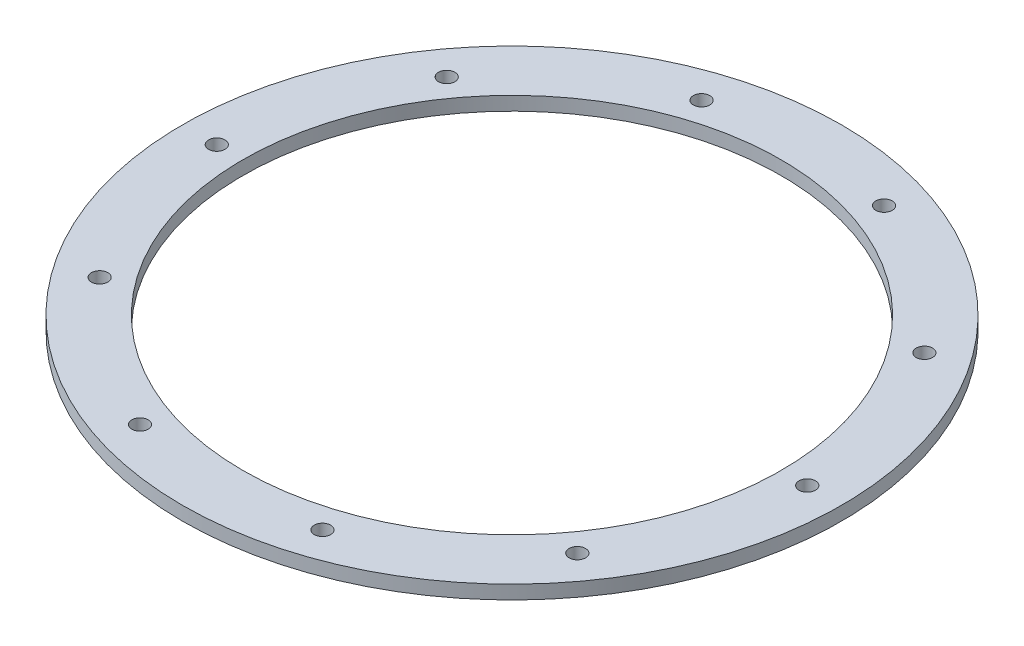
ISO-10303-21;
HEADER;
FILE_DESCRIPTION(('STEP AP214'),'2;1');
FILE_NAME('part.step','',(''),(''),'','','');
FILE_SCHEMA(('AUTOMOTIVE_DESIGN { 1 0 10303 214 1 1 1 1 }'));
ENDSEC;
DATA;
#1=APPLICATION_CONTEXT('core data for automotive mechanical design processes');
#2=APPLICATION_PROTOCOL_DEFINITION('international standard','automotive_design',2000,#1);
#3=PRODUCT_CONTEXT('',#1,'mechanical');
#4=PRODUCT('Part','Part','',(#3));
#5=PRODUCT_RELATED_PRODUCT_CATEGORY('part','',(#4));
#6=PRODUCT_DEFINITION_FORMATION('','',#4);
#7=PRODUCT_DEFINITION_CONTEXT('part definition',#1,'design');
#8=PRODUCT_DEFINITION('design','',#6,#7);
#9=PRODUCT_DEFINITION_SHAPE('','',#8);
#10=(LENGTH_UNIT() NAMED_UNIT(*) SI_UNIT(.MILLI.,.METRE.));
#11=(NAMED_UNIT(*) PLANE_ANGLE_UNIT() SI_UNIT($,.RADIAN.));
#12=(NAMED_UNIT(*) SI_UNIT($,.STERADIAN.) SOLID_ANGLE_UNIT());
#13=UNCERTAINTY_MEASURE_WITH_UNIT(LENGTH_MEASURE(1.E-05),#10,'distance_accuracy_value','');
#14=(GEOMETRIC_REPRESENTATION_CONTEXT(3) GLOBAL_UNCERTAINTY_ASSIGNED_CONTEXT((#13)) GLOBAL_UNIT_ASSIGNED_CONTEXT((#10,
#11,#12)) REPRESENTATION_CONTEXT('',''));
#15=CARTESIAN_POINT('',(0.,0.,0.));
#16=DIRECTION('',(0.,0.,1.));
#17=DIRECTION('',(1.,0.,0.));
#18=AXIS2_PLACEMENT_3D('',#15,#16,#17);
#19=CARTESIAN_POINT('',(0.,3.175,0.));
#20=DIRECTION('',(0.,1.,0.));
#21=DIRECTION('',(0.,0.,1.));
#22=AXIS2_PLACEMENT_3D('',#19,#20,#21);
#23=PLANE('',#22);
#24=CARTESIAN_POINT('',(55.2255225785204,3.175,-40.1236907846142));
#25=DIRECTION('',(0.,1.,0.));
#26=DIRECTION('',(0.,0.,1.));
#27=AXIS2_PLACEMENT_3D('',#24,#25,#26);
#28=CIRCLE('',#27,1.89864999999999);
#29=CARTESIAN_POINT('',(55.2255225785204,3.175,-38.2250407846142));
#30=VERTEX_POINT('',#29);
#31=EDGE_CURVE('E117',#30,#30,#28,.T.);
#32=ORIENTED_EDGE('',*,*,#31,.F.);
#33=EDGE_LOOP('',(#32));
#34=FACE_BOUND('',#33,.T.);
#35=CARTESIAN_POINT('',(21.0942725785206,3.175,-64.9214954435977));
#36=DIRECTION('',(0.,1.,0.));
#37=DIRECTION('',(0.,0.,1.));
#38=AXIS2_PLACEMENT_3D('',#35,#36,#37);
#39=CIRCLE('',#38,1.89864999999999);
#40=CARTESIAN_POINT('',(21.0942725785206,3.175,-63.0228454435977));
#41=VERTEX_POINT('',#40);
#42=EDGE_CURVE('E111',#41,#41,#39,.T.);
#43=ORIENTED_EDGE('',*,*,#42,.F.);
#44=EDGE_LOOP('',(#43));
#45=FACE_BOUND('',#44,.T.);
#46=CARTESIAN_POINT('',(-21.0942725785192,3.175,-64.9214954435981));
#47=DIRECTION('',(0.,1.,0.));
#48=DIRECTION('',(0.,0.,1.));
#49=AXIS2_PLACEMENT_3D('',#46,#47,#48);
#50=CIRCLE('',#49,1.89864999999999);
#51=CARTESIAN_POINT('',(-21.0942725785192,3.175,-63.0228454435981));
#52=VERTEX_POINT('',#51);
#53=EDGE_CURVE('E105',#52,#52,#50,.T.);
#54=ORIENTED_EDGE('',*,*,#53,.F.);
#55=EDGE_LOOP('',(#54));
#56=FACE_BOUND('',#55,.T.);
#57=CARTESIAN_POINT('',(-55.2255225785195,3.175,-40.1236907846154));
#58=DIRECTION('',(0.,1.,0.));
#59=DIRECTION('',(0.,0.,1.));
#60=AXIS2_PLACEMENT_3D('',#57,#58,#59);
#61=CIRCLE('',#60,1.89864999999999);
#62=CARTESIAN_POINT('',(-55.2255225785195,3.175,-38.2250407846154));
#63=VERTEX_POINT('',#62);
#64=EDGE_CURVE('E99',#63,#63,#61,.T.);
#65=ORIENTED_EDGE('',*,*,#64,.F.);
#66=EDGE_LOOP('',(#65));
#67=FACE_BOUND('',#66,.T.);
#68=CARTESIAN_POINT('',(-68.2625,3.175,-4.68315296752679E-13));
#69=DIRECTION('',(0.,1.,0.));
#70=DIRECTION('',(0.,0.,1.));
#71=AXIS2_PLACEMENT_3D('',#68,#69,#70);
#72=CIRCLE('',#71,1.89864999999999);
#73=CARTESIAN_POINT('',(-68.2625,3.175,1.89864999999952));
#74=VERTEX_POINT('',#73);
#75=EDGE_CURVE('E93',#74,#74,#72,.T.);
#76=ORIENTED_EDGE('',*,*,#75,.F.);
#77=EDGE_LOOP('',(#76));
#78=FACE_BOUND('',#77,.T.);
#79=CARTESIAN_POINT('',(-55.2255225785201,3.175,40.1236907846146));
#80=DIRECTION('',(0.,1.,0.));
#81=DIRECTION('',(0.,0.,1.));
#82=AXIS2_PLACEMENT_3D('',#79,#80,#81);
#83=CIRCLE('',#82,1.89864999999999);
#84=CARTESIAN_POINT('',(-55.2255225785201,3.175,42.0223407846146));
#85=VERTEX_POINT('',#84);
#86=EDGE_CURVE('E87',#85,#85,#83,.T.);
#87=ORIENTED_EDGE('',*,*,#86,.F.);
#88=EDGE_LOOP('',(#87));
#89=FACE_BOUND('',#88,.T.);
#90=CARTESIAN_POINT('',(-21.0942725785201,3.175,64.9214954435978));
#91=DIRECTION('',(0.,1.,0.));
#92=DIRECTION('',(0.,0.,1.));
#93=AXIS2_PLACEMENT_3D('',#90,#91,#92);
#94=CIRCLE('',#93,1.89864999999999);
#95=CARTESIAN_POINT('',(-21.0942725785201,3.175,66.8201454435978));
#96=VERTEX_POINT('',#95);
#97=EDGE_CURVE('E81',#96,#96,#94,.T.);
#98=ORIENTED_EDGE('',*,*,#97,.F.);
#99=EDGE_LOOP('',(#98));
#100=FACE_BOUND('',#99,.T.);
#101=CARTESIAN_POINT('',(21.0942725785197,3.175,64.921495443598));
#102=DIRECTION('',(0.,1.,0.));
#103=DIRECTION('',(0.,0.,1.));
#104=AXIS2_PLACEMENT_3D('',#101,#102,#103);
#105=CIRCLE('',#104,1.89864999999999);
#106=CARTESIAN_POINT('',(21.0942725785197,3.175,66.820145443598));
#107=VERTEX_POINT('',#106);
#108=EDGE_CURVE('E75',#107,#107,#105,.T.);
#109=ORIENTED_EDGE('',*,*,#108,.F.);
#110=EDGE_LOOP('',(#109));
#111=FACE_BOUND('',#110,.T.);
#112=CARTESIAN_POINT('',(55.2255225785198,3.175,40.123690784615));
#113=DIRECTION('',(0.,1.,0.));
#114=DIRECTION('',(0.,0.,1.));
#115=AXIS2_PLACEMENT_3D('',#112,#113,#114);
#116=CIRCLE('',#115,1.89864999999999);
#117=CARTESIAN_POINT('',(55.2255225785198,3.175,42.022340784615));
#118=VERTEX_POINT('',#117);
#119=EDGE_CURVE('E69',#118,#118,#116,.T.);
#120=ORIENTED_EDGE('',*,*,#119,.F.);
#121=EDGE_LOOP('',(#120));
#122=FACE_BOUND('',#121,.T.);
#123=CARTESIAN_POINT('',(68.2625,3.175,0.));
#124=DIRECTION('',(0.,1.,0.));
#125=DIRECTION('',(0.,0.,1.));
#126=AXIS2_PLACEMENT_3D('',#123,#124,#125);
#127=CIRCLE('',#126,1.89864999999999);
#128=CARTESIAN_POINT('',(68.2625,3.175,1.89864999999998));
#129=VERTEX_POINT('',#128);
#130=EDGE_CURVE('E63',#129,#129,#127,.T.);
#131=ORIENTED_EDGE('',*,*,#130,.F.);
#132=EDGE_LOOP('',(#131));
#133=FACE_BOUND('',#132,.T.);
#134=CARTESIAN_POINT('',(0.,3.175,0.));
#135=DIRECTION('',(0.,1.,0.));
#136=DIRECTION('',(0.,0.,1.));
#137=AXIS2_PLACEMENT_3D('',#134,#135,#136);
#138=CIRCLE('',#137,76.2);
#139=CARTESIAN_POINT('',(0.,3.175,76.2));
#140=VERTEX_POINT('',#139);
#141=EDGE_CURVE('E12',#140,#140,#138,.T.);
#142=ORIENTED_EDGE('',*,*,#141,.T.);
#143=EDGE_LOOP('',(#142));
#144=FACE_BOUND('',#143,.T.);
#145=CARTESIAN_POINT('',(0.,3.175,0.));
#146=DIRECTION('',(0.,1.,0.));
#147=DIRECTION('',(0.,0.,1.));
#148=AXIS2_PLACEMENT_3D('',#145,#146,#147);
#149=CIRCLE('',#148,62.23);
#150=CARTESIAN_POINT('',(0.,3.175,62.23));
#151=VERTEX_POINT('',#150);
#152=EDGE_CURVE('E54',#151,#151,#149,.T.);
#153=ORIENTED_EDGE('',*,*,#152,.F.);
#154=EDGE_LOOP('',(#153));
#155=FACE_BOUND('',#154,.T.);
#156=ADVANCED_FACE('F43',(#34,#45,#56,#67,#78,#89,#100,#111,#122,#133,#144,#155),#23,.T.);
#157=CARTESIAN_POINT('',(0.,0.,0.));
#158=DIRECTION('',(0.,1.,0.));
#159=DIRECTION('',(0.,0.,1.));
#160=AXIS2_PLACEMENT_3D('',#157,#158,#159);
#161=PLANE('',#160);
#162=CARTESIAN_POINT('',(55.2255225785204,1.18221404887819E-12,-40.1236907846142));
#163=DIRECTION('',(0.,1.,0.));
#164=DIRECTION('',(0.,0.,1.));
#165=AXIS2_PLACEMENT_3D('',#162,#163,#164);
#166=CIRCLE('',#165,1.89864999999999);
#167=CARTESIAN_POINT('',(55.2255225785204,1.18221404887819E-12,-38.2250407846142));
#168=VERTEX_POINT('',#167);
#169=EDGE_CURVE('E120',#168,#168,#166,.T.);
#170=ORIENTED_EDGE('',*,*,#169,.T.);
#171=EDGE_LOOP('',(#170));
#172=FACE_BOUND('',#171,.T.);
#173=CARTESIAN_POINT('',(21.0942725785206,1.18221404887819E-12,-64.9214954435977));
#174=DIRECTION('',(0.,1.,0.));
#175=DIRECTION('',(0.,0.,1.));
#176=AXIS2_PLACEMENT_3D('',#173,#174,#175);
#177=CIRCLE('',#176,1.89864999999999);
#178=CARTESIAN_POINT('',(21.0942725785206,1.18221404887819E-12,-63.0228454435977));
#179=VERTEX_POINT('',#178);
#180=EDGE_CURVE('E114',#179,#179,#177,.T.);
#181=ORIENTED_EDGE('',*,*,#180,.T.);
#182=EDGE_LOOP('',(#181));
#183=FACE_BOUND('',#182,.T.);
#184=CARTESIAN_POINT('',(-21.0942725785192,1.18221404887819E-12,-64.9214954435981));
#185=DIRECTION('',(0.,1.,0.));
#186=DIRECTION('',(0.,0.,1.));
#187=AXIS2_PLACEMENT_3D('',#184,#185,#186);
#188=CIRCLE('',#187,1.89864999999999);
#189=CARTESIAN_POINT('',(-21.0942725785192,1.18221404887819E-12,-63.0228454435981));
#190=VERTEX_POINT('',#189);
#191=EDGE_CURVE('E108',#190,#190,#188,.T.);
#192=ORIENTED_EDGE('',*,*,#191,.T.);
#193=EDGE_LOOP('',(#192));
#194=FACE_BOUND('',#193,.T.);
#195=CARTESIAN_POINT('',(-55.2255225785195,1.18221404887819E-12,-40.1236907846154));
#196=DIRECTION('',(0.,1.,0.));
#197=DIRECTION('',(0.,0.,1.));
#198=AXIS2_PLACEMENT_3D('',#195,#196,#197);
#199=CIRCLE('',#198,1.89864999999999);
#200=CARTESIAN_POINT('',(-55.2255225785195,1.18221404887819E-12,-38.2250407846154));
#201=VERTEX_POINT('',#200);
#202=EDGE_CURVE('E102',#201,#201,#199,.T.);
#203=ORIENTED_EDGE('',*,*,#202,.T.);
#204=EDGE_LOOP('',(#203));
#205=FACE_BOUND('',#204,.T.);
#206=CARTESIAN_POINT('',(-68.2625,1.18221404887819E-12,-4.68315296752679E-13));
#207=DIRECTION('',(0.,1.,0.));
#208=DIRECTION('',(0.,0.,1.));
#209=AXIS2_PLACEMENT_3D('',#206,#207,#208);
#210=CIRCLE('',#209,1.89864999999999);
#211=CARTESIAN_POINT('',(-68.2625,1.18221404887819E-12,1.89864999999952));
#212=VERTEX_POINT('',#211);
#213=EDGE_CURVE('E96',#212,#212,#210,.T.);
#214=ORIENTED_EDGE('',*,*,#213,.T.);
#215=EDGE_LOOP('',(#214));
#216=FACE_BOUND('',#215,.T.);
#217=CARTESIAN_POINT('',(-55.2255225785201,1.18221404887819E-12,40.1236907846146));
#218=DIRECTION('',(0.,1.,0.));
#219=DIRECTION('',(0.,0.,1.));
#220=AXIS2_PLACEMENT_3D('',#217,#218,#219);
#221=CIRCLE('',#220,1.89864999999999);
#222=CARTESIAN_POINT('',(-55.2255225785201,1.18221404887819E-12,42.0223407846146));
#223=VERTEX_POINT('',#222);
#224=EDGE_CURVE('E90',#223,#223,#221,.T.);
#225=ORIENTED_EDGE('',*,*,#224,.T.);
#226=EDGE_LOOP('',(#225));
#227=FACE_BOUND('',#226,.T.);
#228=CARTESIAN_POINT('',(-21.0942725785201,1.18221404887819E-12,64.9214954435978));
#229=DIRECTION('',(0.,1.,0.));
#230=DIRECTION('',(0.,0.,1.));
#231=AXIS2_PLACEMENT_3D('',#228,#229,#230);
#232=CIRCLE('',#231,1.89864999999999);
#233=CARTESIAN_POINT('',(-21.0942725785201,1.18221404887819E-12,66.8201454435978));
#234=VERTEX_POINT('',#233);
#235=EDGE_CURVE('E84',#234,#234,#232,.T.);
#236=ORIENTED_EDGE('',*,*,#235,.T.);
#237=EDGE_LOOP('',(#236));
#238=FACE_BOUND('',#237,.T.);
#239=CARTESIAN_POINT('',(21.0942725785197,1.18221404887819E-12,64.921495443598));
#240=DIRECTION('',(0.,1.,0.));
#241=DIRECTION('',(0.,0.,1.));
#242=AXIS2_PLACEMENT_3D('',#239,#240,#241);
#243=CIRCLE('',#242,1.89864999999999);
#244=CARTESIAN_POINT('',(21.0942725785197,1.18221404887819E-12,66.820145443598));
#245=VERTEX_POINT('',#244);
#246=EDGE_CURVE('E78',#245,#245,#243,.T.);
#247=ORIENTED_EDGE('',*,*,#246,.T.);
#248=EDGE_LOOP('',(#247));
#249=FACE_BOUND('',#248,.T.);
#250=CARTESIAN_POINT('',(55.2255225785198,1.18221404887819E-12,40.123690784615));
#251=DIRECTION('',(0.,1.,0.));
#252=DIRECTION('',(0.,0.,1.));
#253=AXIS2_PLACEMENT_3D('',#250,#251,#252);
#254=CIRCLE('',#253,1.89864999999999);
#255=CARTESIAN_POINT('',(55.2255225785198,1.18221404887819E-12,42.022340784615));
#256=VERTEX_POINT('',#255);
#257=EDGE_CURVE('E72',#256,#256,#254,.T.);
#258=ORIENTED_EDGE('',*,*,#257,.T.);
#259=EDGE_LOOP('',(#258));
#260=FACE_BOUND('',#259,.T.);
#261=CARTESIAN_POINT('',(68.2625,1.18221404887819E-12,0.));
#262=DIRECTION('',(0.,1.,0.));
#263=DIRECTION('',(0.,0.,1.));
#264=AXIS2_PLACEMENT_3D('',#261,#262,#263);
#265=CIRCLE('',#264,1.89864999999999);
#266=CARTESIAN_POINT('',(68.2625,1.18221404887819E-12,1.89864999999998));
#267=VERTEX_POINT('',#266);
#268=EDGE_CURVE('E66',#267,#267,#265,.T.);
#269=ORIENTED_EDGE('',*,*,#268,.T.);
#270=EDGE_LOOP('',(#269));
#271=FACE_BOUND('',#270,.T.);
#272=CARTESIAN_POINT('',(0.,0.,0.));
#273=DIRECTION('',(0.,1.,0.));
#274=DIRECTION('',(0.,0.,1.));
#275=AXIS2_PLACEMENT_3D('',#272,#273,#274);
#276=CIRCLE('',#275,76.2);
#277=CARTESIAN_POINT('',(0.,0.,76.2));
#278=VERTEX_POINT('',#277);
#279=EDGE_CURVE('E50',#278,#278,#276,.T.);
#280=ORIENTED_EDGE('',*,*,#279,.F.);
#281=EDGE_LOOP('',(#280));
#282=FACE_BOUND('',#281,.T.);
#283=CARTESIAN_POINT('',(0.,0.,0.));
#284=DIRECTION('',(0.,1.,0.));
#285=DIRECTION('',(0.,0.,1.));
#286=AXIS2_PLACEMENT_3D('',#283,#284,#285);
#287=CIRCLE('',#286,62.23);
#288=CARTESIAN_POINT('',(0.,0.,62.23));
#289=VERTEX_POINT('',#288);
#290=EDGE_CURVE('E58',#289,#289,#287,.T.);
#291=ORIENTED_EDGE('',*,*,#290,.T.);
#292=EDGE_LOOP('',(#291));
#293=FACE_BOUND('',#292,.T.);
#294=ADVANCED_FACE('F124',(#172,#183,#194,#205,#216,#227,#238,#249,#260,#271,#282,#293),#161,.F.);
#295=CARTESIAN_POINT('',(0.,3.175,0.));
#296=DIRECTION('',(0.,-1.,0.));
#297=DIRECTION('',(0.,0.,-1.));
#298=AXIS2_PLACEMENT_3D('',#295,#296,#297);
#299=CYLINDRICAL_SURFACE('',#298,76.2);
#300=ORIENTED_EDGE('',*,*,#141,.F.);
#301=EDGE_LOOP('',(#300));
#302=FACE_BOUND('',#301,.T.);
#303=ORIENTED_EDGE('',*,*,#279,.T.);
#304=EDGE_LOOP('',(#303));
#305=FACE_BOUND('',#304,.T.);
#306=ADVANCED_FACE('F45',(#302,#305),#299,.T.);
#307=CARTESIAN_POINT('',(0.,3.175,0.));
#308=DIRECTION('',(0.,-1.,0.));
#309=DIRECTION('',(0.,0.,-1.));
#310=AXIS2_PLACEMENT_3D('',#307,#308,#309);
#311=CYLINDRICAL_SURFACE('',#310,62.23);
#312=ORIENTED_EDGE('',*,*,#152,.T.);
#313=EDGE_LOOP('',(#312));
#314=FACE_BOUND('',#313,.T.);
#315=ORIENTED_EDGE('',*,*,#290,.F.);
#316=EDGE_LOOP('',(#315));
#317=FACE_BOUND('',#316,.T.);
#318=ADVANCED_FACE('F156',(#314,#317),#311,.F.);
#319=CARTESIAN_POINT('',(68.2625,3.175,0.));
#320=DIRECTION('',(0.,1.,0.));
#321=DIRECTION('',(0.,0.,1.));
#322=AXIS2_PLACEMENT_3D('',#319,#320,#321);
#323=CYLINDRICAL_SURFACE('',#322,1.89864999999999);
#324=ORIENTED_EDGE('',*,*,#268,.F.);
#325=EDGE_LOOP('',(#324));
#326=FACE_BOUND('',#325,.T.);
#327=ORIENTED_EDGE('',*,*,#130,.T.);
#328=EDGE_LOOP('',(#327));
#329=FACE_BOUND('',#328,.T.);
#330=ADVANCED_FACE('F159',(#326,#329),#323,.F.);
#331=CARTESIAN_POINT('',(55.2255225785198,3.175,40.123690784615));
#332=DIRECTION('',(0.,1.,0.));
#333=DIRECTION('',(0.,0.,1.));
#334=AXIS2_PLACEMENT_3D('',#331,#332,#333);
#335=CYLINDRICAL_SURFACE('',#334,1.89864999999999);
#336=ORIENTED_EDGE('',*,*,#257,.F.);
#337=EDGE_LOOP('',(#336));
#338=FACE_BOUND('',#337,.T.);
#339=ORIENTED_EDGE('',*,*,#119,.T.);
#340=EDGE_LOOP('',(#339));
#341=FACE_BOUND('',#340,.T.);
#342=ADVANCED_FACE('F173',(#338,#341),#335,.F.);
#343=CARTESIAN_POINT('',(21.0942725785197,3.175,64.921495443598));
#344=DIRECTION('',(0.,1.,0.));
#345=DIRECTION('',(0.,0.,1.));
#346=AXIS2_PLACEMENT_3D('',#343,#344,#345);
#347=CYLINDRICAL_SURFACE('',#346,1.89864999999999);
#348=ORIENTED_EDGE('',*,*,#246,.F.);
#349=EDGE_LOOP('',(#348));
#350=FACE_BOUND('',#349,.T.);
#351=ORIENTED_EDGE('',*,*,#108,.T.);
#352=EDGE_LOOP('',(#351));
#353=FACE_BOUND('',#352,.T.);
#354=ADVANCED_FACE('F176',(#350,#353),#347,.F.);
#355=CARTESIAN_POINT('',(-21.0942725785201,3.175,64.9214954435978));
#356=DIRECTION('',(0.,1.,0.));
#357=DIRECTION('',(0.,0.,1.));
#358=AXIS2_PLACEMENT_3D('',#355,#356,#357);
#359=CYLINDRICAL_SURFACE('',#358,1.89864999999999);
#360=ORIENTED_EDGE('',*,*,#235,.F.);
#361=EDGE_LOOP('',(#360));
#362=FACE_BOUND('',#361,.T.);
#363=ORIENTED_EDGE('',*,*,#97,.T.);
#364=EDGE_LOOP('',(#363));
#365=FACE_BOUND('',#364,.T.);
#366=ADVANCED_FACE('F180',(#362,#365),#359,.F.);
#367=CARTESIAN_POINT('',(-55.2255225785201,3.175,40.1236907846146));
#368=DIRECTION('',(0.,1.,0.));
#369=DIRECTION('',(0.,0.,1.));
#370=AXIS2_PLACEMENT_3D('',#367,#368,#369);
#371=CYLINDRICAL_SURFACE('',#370,1.89864999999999);
#372=ORIENTED_EDGE('',*,*,#224,.F.);
#373=EDGE_LOOP('',(#372));
#374=FACE_BOUND('',#373,.T.);
#375=ORIENTED_EDGE('',*,*,#86,.T.);
#376=EDGE_LOOP('',(#375));
#377=FACE_BOUND('',#376,.T.);
#378=ADVANCED_FACE('F184',(#374,#377),#371,.F.);
#379=CARTESIAN_POINT('',(-68.2625,3.175,-4.68315296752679E-13));
#380=DIRECTION('',(0.,1.,0.));
#381=DIRECTION('',(0.,0.,1.));
#382=AXIS2_PLACEMENT_3D('',#379,#380,#381);
#383=CYLINDRICAL_SURFACE('',#382,1.89864999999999);
#384=ORIENTED_EDGE('',*,*,#213,.F.);
#385=EDGE_LOOP('',(#384));
#386=FACE_BOUND('',#385,.T.);
#387=ORIENTED_EDGE('',*,*,#75,.T.);
#388=EDGE_LOOP('',(#387));
#389=FACE_BOUND('',#388,.T.);
#390=ADVANCED_FACE('F188',(#386,#389),#383,.F.);
#391=CARTESIAN_POINT('',(-55.2255225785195,3.175,-40.1236907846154));
#392=DIRECTION('',(0.,1.,0.));
#393=DIRECTION('',(0.,0.,1.));
#394=AXIS2_PLACEMENT_3D('',#391,#392,#393);
#395=CYLINDRICAL_SURFACE('',#394,1.89864999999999);
#396=ORIENTED_EDGE('',*,*,#202,.F.);
#397=EDGE_LOOP('',(#396));
#398=FACE_BOUND('',#397,.T.);
#399=ORIENTED_EDGE('',*,*,#64,.T.);
#400=EDGE_LOOP('',(#399));
#401=FACE_BOUND('',#400,.T.);
#402=ADVANCED_FACE('F192',(#398,#401),#395,.F.);
#403=CARTESIAN_POINT('',(-21.0942725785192,3.175,-64.9214954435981));
#404=DIRECTION('',(0.,1.,0.));
#405=DIRECTION('',(0.,0.,1.));
#406=AXIS2_PLACEMENT_3D('',#403,#404,#405);
#407=CYLINDRICAL_SURFACE('',#406,1.89864999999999);
#408=ORIENTED_EDGE('',*,*,#191,.F.);
#409=EDGE_LOOP('',(#408));
#410=FACE_BOUND('',#409,.T.);
#411=ORIENTED_EDGE('',*,*,#53,.T.);
#412=EDGE_LOOP('',(#411));
#413=FACE_BOUND('',#412,.T.);
#414=ADVANCED_FACE('F196',(#410,#413),#407,.F.);
#415=CARTESIAN_POINT('',(21.0942725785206,3.175,-64.9214954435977));
#416=DIRECTION('',(0.,1.,0.));
#417=DIRECTION('',(0.,0.,1.));
#418=AXIS2_PLACEMENT_3D('',#415,#416,#417);
#419=CYLINDRICAL_SURFACE('',#418,1.89864999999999);
#420=ORIENTED_EDGE('',*,*,#180,.F.);
#421=EDGE_LOOP('',(#420));
#422=FACE_BOUND('',#421,.T.);
#423=ORIENTED_EDGE('',*,*,#42,.T.);
#424=EDGE_LOOP('',(#423));
#425=FACE_BOUND('',#424,.T.);
#426=ADVANCED_FACE('F130',(#422,#425),#419,.F.);
#427=CARTESIAN_POINT('',(55.2255225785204,3.175,-40.1236907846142));
#428=DIRECTION('',(0.,1.,0.));
#429=DIRECTION('',(0.,0.,1.));
#430=AXIS2_PLACEMENT_3D('',#427,#428,#429);
#431=CYLINDRICAL_SURFACE('',#430,1.89864999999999);
#432=ORIENTED_EDGE('',*,*,#169,.F.);
#433=EDGE_LOOP('',(#432));
#434=FACE_BOUND('',#433,.T.);
#435=ORIENTED_EDGE('',*,*,#31,.T.);
#436=EDGE_LOOP('',(#435));
#437=FACE_BOUND('',#436,.T.);
#438=ADVANCED_FACE('F127',(#434,#437),#431,.F.);
#439=CLOSED_SHELL('',(#156,#294,#306,#318,#330,#342,#354,#366,#378,#390,#402,#414,#426,#438));
#440=MANIFOLD_SOLID_BREP('B2',#439);
#441=ADVANCED_BREP_SHAPE_REPRESENTATION('',(#18,#440),#14);
#442=SHAPE_DEFINITION_REPRESENTATION(#9,#441);
ENDSEC;
END-ISO-10303-21;
